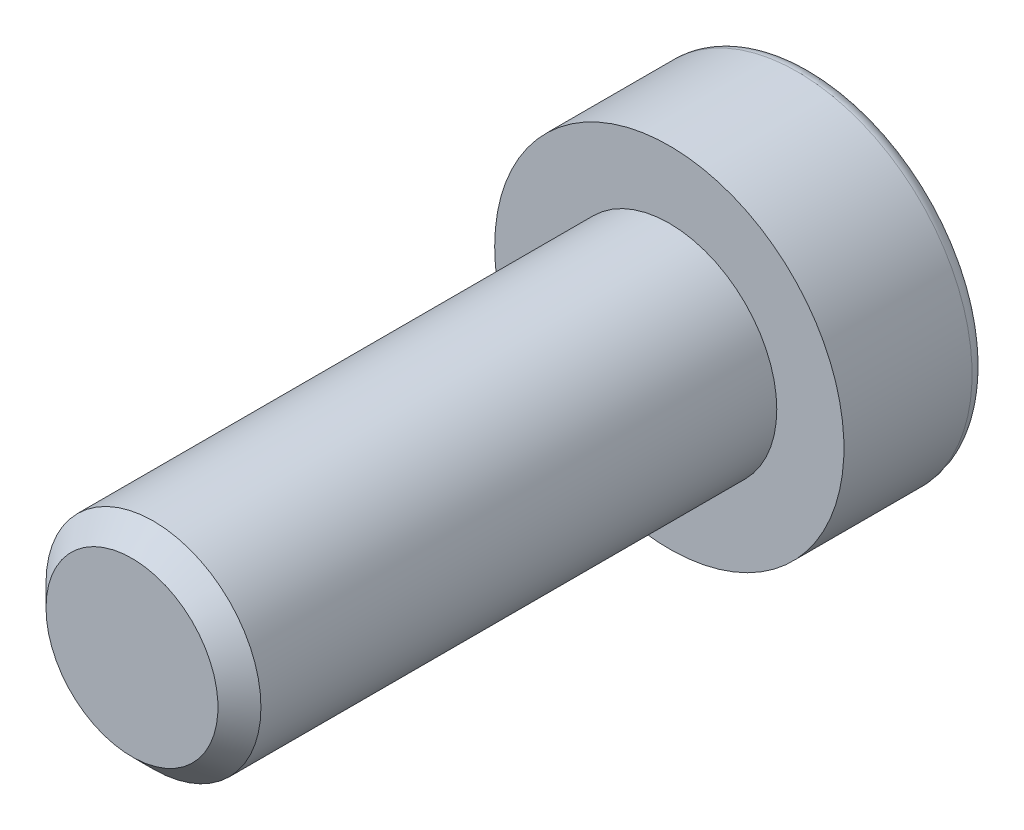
from build123d import *

# Parameters (mm, degrees)
ENLEV_MAT_EXTRU1_DEPTH = 4
ESQUISSE3_W            = 4
ESQUISSE3_H            = 20
CHANFREIN1_SIZE        = 0.8


with BuildPart() as part:
    # Esquisse1 → Base-R_volution (revolve)
    with BuildSketch(Plane(origin=(0, 0, 0), x_dir=(1, 0, 0), z_dir=(0, 1, 0)), mode=Mode.PRIVATE) as base_r_volution_sk:
        with BuildLine():
            Line((0, 0), (6.5, 0))
            Line((6.5, 0), (6.5, 4.77))
            ThreePointArc((6.5, 4.77), (6.344766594, 5.144766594), (5.97, 5.3))
            Line((5.97, 5.3), (0, 5.3))
            Line((0, 5.3), (0, 0))
        make_face()
    revolve(base_r_volution_sk.sketch.rotate(Axis((0, 0, 0), (0, 0, -1)), 180), axis=Axis((0, 0, 0), (0, 0, -1)))

    # Esquisse2 → enlev-mat-Extru1 (cut)
    with BuildSketch(Plane.XY.offset(-5.3)):
        Polygon((3, -1.732050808), (3, 1.732050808), (0, 3.464101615), (-3, 1.732050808), (-3, -1.732050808), (0, -3.464101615), align=None)
    extrude(amount=ENLEV_MAT_EXTRU1_DEPTH, mode=Mode.SUBTRACT)

    # Esquisse3 → Boss.-R_vol.1 (revolve)
    with BuildSketch(Plane(origin=(0, 0, 0), x_dir=(1, 0, 0), z_dir=(0, 1, 0))):
        with Locations((2, -10)):
            Rectangle(ESQUISSE3_W, ESQUISSE3_H)
    revolve(axis=Axis((0, 0, 0), (0, 0, 1)))

    # Chanfrein1
    chanfrein1_edges = [part.edges().sort_by_distance(p)[0] for p in [
        (-4, 0, 20),
    ]]
    chamfer(chanfrein1_edges, length=CHANFREIN1_SIZE)


solid = part.part
